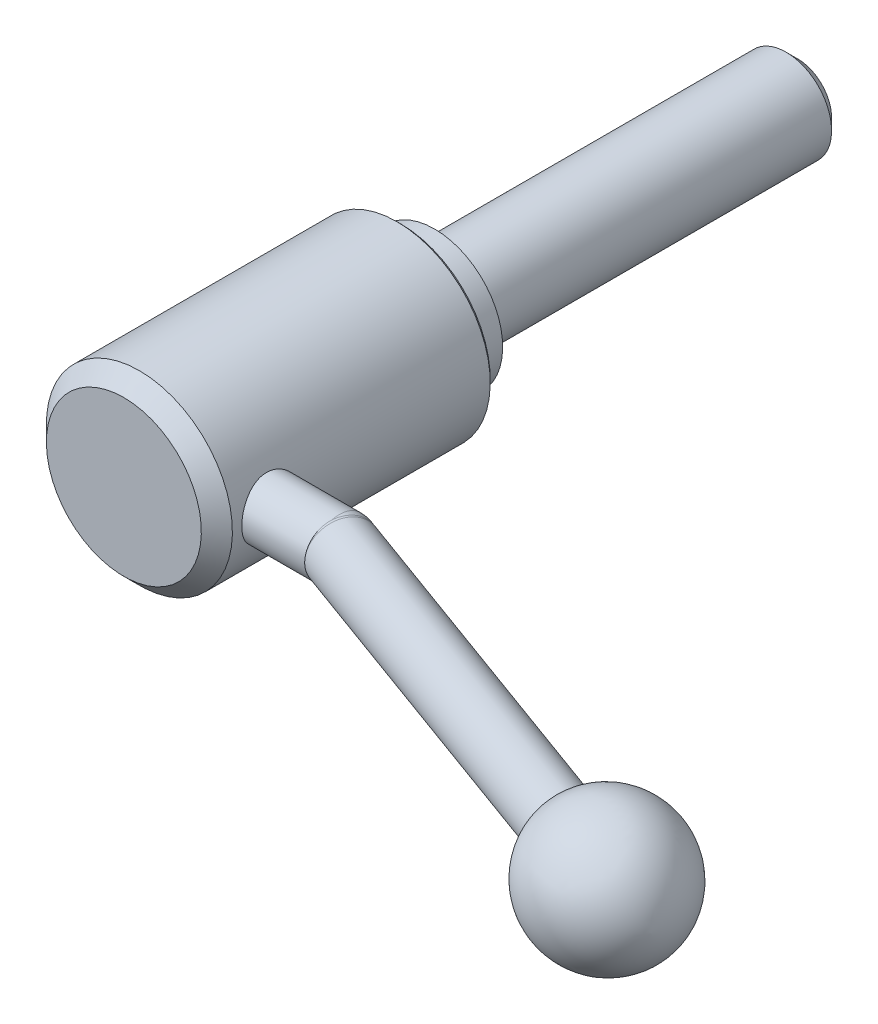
ISO-10303-21;
HEADER;
FILE_DESCRIPTION(('STEP AP214'),'2;1');
FILE_NAME('part.step','',(''),(''),'','','');
FILE_SCHEMA(('AUTOMOTIVE_DESIGN { 1 0 10303 214 1 1 1 1 }'));
ENDSEC;
DATA;
#1=APPLICATION_CONTEXT('core data for automotive mechanical design processes');
#2=APPLICATION_PROTOCOL_DEFINITION('international standard','automotive_design',2000,#1);
#3=PRODUCT_CONTEXT('',#1,'mechanical');
#4=PRODUCT('Part','Part','',(#3));
#5=PRODUCT_RELATED_PRODUCT_CATEGORY('part','',(#4));
#6=PRODUCT_DEFINITION_FORMATION('','',#4);
#7=PRODUCT_DEFINITION_CONTEXT('part definition',#1,'design');
#8=PRODUCT_DEFINITION('design','',#6,#7);
#9=PRODUCT_DEFINITION_SHAPE('','',#8);
#10=(LENGTH_UNIT() NAMED_UNIT(*) SI_UNIT(.MILLI.,.METRE.));
#11=(NAMED_UNIT(*) PLANE_ANGLE_UNIT() SI_UNIT($,.RADIAN.));
#12=(NAMED_UNIT(*) SI_UNIT($,.STERADIAN.) SOLID_ANGLE_UNIT());
#13=UNCERTAINTY_MEASURE_WITH_UNIT(LENGTH_MEASURE(1.E-05),#10,'distance_accuracy_value','');
#14=(GEOMETRIC_REPRESENTATION_CONTEXT(3) GLOBAL_UNCERTAINTY_ASSIGNED_CONTEXT((#13)) GLOBAL_UNIT_ASSIGNED_CONTEXT((#10,
#11,#12)) REPRESENTATION_CONTEXT('',''));
#15=CARTESIAN_POINT('',(0.,0.,0.));
#16=DIRECTION('',(0.,0.,1.));
#17=DIRECTION('',(1.,0.,0.));
#18=AXIS2_PLACEMENT_3D('',#15,#16,#17);
#19=CARTESIAN_POINT('',(0.,0.,0.));
#20=DIRECTION('',(0.,0.,-1.));
#21=DIRECTION('',(0.,1.,0.));
#22=AXIS2_PLACEMENT_3D('',#19,#20,#21);
#23=CYLINDRICAL_SURFACE('',#22,20.5);
#24=CARTESIAN_POINT('',(0.,0.,8.25));
#25=DIRECTION('',(0.,0.,-1.));
#26=DIRECTION('',(0.,1.,0.));
#27=AXIS2_PLACEMENT_3D('',#24,#25,#26);
#28=CIRCLE('',#27,20.5);
#29=CARTESIAN_POINT('',(0.,20.5,8.25));
#30=VERTEX_POINT('',#29);
#31=EDGE_CURVE('E160',#30,#30,#28,.T.);
#32=ORIENTED_EDGE('',*,*,#31,.F.);
#33=EDGE_LOOP('',(#32));
#34=FACE_BOUND('',#33,.T.);
#35=CARTESIAN_POINT('',(19.4422220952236,6.5,56.5));
#36=CARTESIAN_POINT('',(19.4422222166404,6.49999984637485,56.6775608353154));
#37=CARTESIAN_POINT('',(19.4446611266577,6.49271825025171,56.8551242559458));
#38=CARTESIAN_POINT('',(19.454338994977,6.46366201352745,57.2089295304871));
#39=CARTESIAN_POINT('',(19.4615780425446,6.44188710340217,57.3851713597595));
#40=CARTESIAN_POINT('',(19.4806268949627,6.38405046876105,57.7350468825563));
#41=CARTESIAN_POINT('',(19.4924368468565,6.34798828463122,57.9086804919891));
#42=CARTESIAN_POINT('',(19.5202654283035,6.26189122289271,58.2521641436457));
#43=CARTESIAN_POINT('',(19.5362855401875,6.2118514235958,58.4220128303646));
#44=CARTESIAN_POINT('',(19.5720112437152,6.09835258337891,58.7563693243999));
#45=CARTESIAN_POINT('',(19.5917092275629,6.03492120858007,58.9208873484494));
#46=CARTESIAN_POINT('',(19.6342385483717,5.89508386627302,59.2438952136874));
#47=CARTESIAN_POINT('',(19.6570700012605,5.8186774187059,59.4023848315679));
#48=CARTESIAN_POINT('',(19.7052295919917,5.65343532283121,59.7124029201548));
#49=CARTESIAN_POINT('',(19.7305584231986,5.5645962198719,59.8639294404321));
#50=CARTESIAN_POINT('',(19.7830095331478,5.37514542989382,60.159036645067));
#51=CARTESIAN_POINT('',(19.810131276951,5.27453724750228,60.3026196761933));
#52=CARTESIAN_POINT('',(19.8663573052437,5.05872294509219,60.5855845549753));
#53=CARTESIAN_POINT('',(19.8954973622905,4.94314912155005,60.7246789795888));
#54=CARTESIAN_POINT('',(19.9541229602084,4.70090397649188,60.9926738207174));
#55=CARTESIAN_POINT('',(19.9836083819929,4.57423638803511,61.1215776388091));
#56=CARTESIAN_POINT('',(20.0421539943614,4.31048905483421,61.3685042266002));
#57=CARTESIAN_POINT('',(20.071213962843,4.1734040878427,61.4865214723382));
#58=CARTESIAN_POINT('',(20.1281044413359,3.88977145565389,61.7107919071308));
#59=CARTESIAN_POINT('',(20.1559354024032,3.74322731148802,61.8170494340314));
#60=CARTESIAN_POINT('',(20.2102746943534,3.43793523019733,62.0195055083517));
#61=CARTESIAN_POINT('',(20.236735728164,3.2789797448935,62.1154041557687));
#62=CARTESIAN_POINT('',(20.2868421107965,2.95316588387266,62.2933802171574));
#63=CARTESIAN_POINT('',(20.3104885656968,2.786310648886,62.3754630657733));
#64=CARTESIAN_POINT('',(20.3543059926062,2.44575238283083,62.5251888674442));
#65=CARTESIAN_POINT('',(20.3744761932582,2.27204784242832,62.5928286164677));
#66=CARTESIAN_POINT('',(20.4107390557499,1.9191592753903,62.7130148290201));
#67=CARTESIAN_POINT('',(20.4268335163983,1.73997770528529,62.7655679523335));
#68=CARTESIAN_POINT('',(20.4540467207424,1.38310784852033,62.8537177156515));
#69=CARTESIAN_POINT('',(20.4653055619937,1.20554867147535,62.8897940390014));
#70=CARTESIAN_POINT('',(20.483240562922,0.847880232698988,62.9470057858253));
#71=CARTESIAN_POINT('',(20.489918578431,0.667772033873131,62.9681472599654));
#72=CARTESIAN_POINT('',(20.4985086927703,0.306306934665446,62.9953079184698));
#73=CARTESIAN_POINT('',(20.5004208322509,0.124950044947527,63.0013272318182));
#74=CARTESIAN_POINT('',(20.4994243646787,-0.237616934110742,62.9981845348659));
#75=CARTESIAN_POINT('',(20.4965158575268,-0.418827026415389,62.9890228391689));
#76=CARTESIAN_POINT('',(20.4861511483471,-0.773249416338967,62.9562077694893));
#77=CARTESIAN_POINT('',(20.4788613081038,-0.946515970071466,62.9330843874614));
#78=CARTESIAN_POINT('',(20.4600679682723,-1.29046183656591,62.8730051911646));
#79=CARTESIAN_POINT('',(20.4485630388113,-1.46114025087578,62.8360446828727));
#80=CARTESIAN_POINT('',(20.4216452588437,-1.798625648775,62.7486256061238));
#81=CARTESIAN_POINT('',(20.4062336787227,-1.9654338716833,62.6981714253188));
#82=CARTESIAN_POINT('',(20.3718916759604,-2.29420139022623,62.5841535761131));
#83=CARTESIAN_POINT('',(20.35295992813,-2.45615883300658,62.5205849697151));
#84=CARTESIAN_POINT('',(20.3118147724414,-2.77605889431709,62.3799991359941));
#85=CARTESIAN_POINT('',(20.2895645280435,-2.93392950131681,62.3028289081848));
#86=CARTESIAN_POINT('',(20.2425168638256,-3.24266972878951,62.1361230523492));
#87=CARTESIAN_POINT('',(20.2177185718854,-3.39353692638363,62.0465831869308));
#88=CARTESIAN_POINT('',(20.1662066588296,-3.68732340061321,61.8557751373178));
#89=CARTESIAN_POINT('',(20.1394929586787,-3.8302423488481,61.7545064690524));
#90=CARTESIAN_POINT('',(20.0848204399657,-4.10730208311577,61.5408997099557));
#91=CARTESIAN_POINT('',(20.0568615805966,-4.24144258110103,61.4285612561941));
#92=CARTESIAN_POINT('',(19.9991827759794,-4.50574800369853,61.1884400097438));
#93=CARTESIAN_POINT('',(19.9694388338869,-4.63549313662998,61.0602005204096));
#94=CARTESIAN_POINT('',(19.9101839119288,-4.88373422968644,60.7932909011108));
#95=CARTESIAN_POINT('',(19.8806728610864,-5.00223374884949,60.6546240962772));
#96=CARTESIAN_POINT('',(19.8226810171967,-5.22731613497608,60.3676143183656));
#97=CARTESIAN_POINT('',(19.7942007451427,-5.33389303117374,60.2192665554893));
#98=CARTESIAN_POINT('',(19.739110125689,-5.53428674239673,59.9139422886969));
#99=CARTESIAN_POINT('',(19.7124990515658,-5.62810852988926,59.7569691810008));
#100=CARTESIAN_POINT('',(19.6616069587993,-5.80341705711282,59.4333642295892));
#101=CARTESIAN_POINT('',(19.6373585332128,-5.88473833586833,59.2666375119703));
#102=CARTESIAN_POINT('',(19.5923338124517,-6.03294761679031,58.9265081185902));
#103=CARTESIAN_POINT('',(19.5715561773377,-6.09984119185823,58.7531080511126));
#104=CARTESIAN_POINT('',(19.5341361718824,-6.21863379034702,58.4008267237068));
#105=CARTESIAN_POINT('',(19.5174933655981,-6.2705343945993,58.2219460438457));
#106=CARTESIAN_POINT('',(19.4888985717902,-6.35885149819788,57.8600357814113));
#107=CARTESIAN_POINT('',(19.4769463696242,-6.39526870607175,57.6770063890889));
#108=CARTESIAN_POINT('',(19.4585313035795,-6.45107630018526,57.3158506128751));
#109=CARTESIAN_POINT('',(19.4518622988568,-6.47110721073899,57.1378335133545));
#110=CARTESIAN_POINT('',(19.443427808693,-6.49640633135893,56.7806394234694));
#111=CARTESIAN_POINT('',(19.4416621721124,-6.50167499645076,56.6014624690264));
#112=CARTESIAN_POINT('',(19.443091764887,-6.49739848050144,56.2433320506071));
#113=CARTESIAN_POINT('',(19.4462862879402,-6.48785540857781,56.0643785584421));
#114=CARTESIAN_POINT('',(19.4575309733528,-6.45405335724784,55.7080231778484));
#115=CARTESIAN_POINT('',(19.4655810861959,-6.4297945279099,55.5306212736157));
#116=CARTESIAN_POINT('',(19.4859636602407,-6.36775067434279,55.1840196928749));
#117=CARTESIAN_POINT('',(19.4981590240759,-6.33039761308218,55.0147343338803));
#118=CARTESIAN_POINT('',(19.5265148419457,-6.24238368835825,54.6799411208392));
#119=CARTESIAN_POINT('',(19.5426766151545,-6.19171839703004,54.5144345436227));
#120=CARTESIAN_POINT('',(19.5784935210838,-6.07751333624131,54.1883625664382));
#121=CARTESIAN_POINT('',(19.598147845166,-6.01397654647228,54.0277960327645));
#122=CARTESIAN_POINT('',(19.6404122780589,-5.87448001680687,53.7124890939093));
#123=CARTESIAN_POINT('',(19.663023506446,-5.79851556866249,53.5577509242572));
#124=CARTESIAN_POINT('',(19.711276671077,-5.63234141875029,53.2506795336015));
#125=CARTESIAN_POINT('',(19.7369874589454,-5.54178262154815,53.0985460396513));
#126=CARTESIAN_POINT('',(19.7901869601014,-5.34869406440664,52.8023330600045));
#127=CARTESIAN_POINT('',(19.8176762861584,-5.24616016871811,52.6582563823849));
#128=CARTESIAN_POINT('',(19.8736901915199,-5.02980339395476,52.3790447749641));
#129=CARTESIAN_POINT('',(19.9022148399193,-4.91597976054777,52.2439104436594));
#130=CARTESIAN_POINT('',(19.9595511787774,-4.67774787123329,51.9833824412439));
#131=CARTESIAN_POINT('',(19.9883628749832,-4.55333940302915,51.8579889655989));
#132=CARTESIAN_POINT('',(20.0467640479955,-4.28909489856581,51.612508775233));
#133=CARTESIAN_POINT('',(20.0763335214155,-4.14882502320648,51.4928837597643));
#134=CARTESIAN_POINT('',(20.1341446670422,-3.85851185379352,51.2658977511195));
#135=CARTESIAN_POINT('',(20.1623867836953,-3.70847187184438,51.1585326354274));
#136=CARTESIAN_POINT('',(20.2167791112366,-3.39947872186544,50.956751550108));
#137=CARTESIAN_POINT('',(20.2429285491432,-3.24052229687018,50.8623403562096));
#138=CARTESIAN_POINT('',(20.2923799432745,-2.91486277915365,50.6872782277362));
#139=CARTESIAN_POINT('',(20.31568308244,-2.74816294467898,50.606621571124));
#140=CARTESIAN_POINT('',(20.3586447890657,-2.40926409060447,50.4601915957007));
#141=CARTESIAN_POINT('',(20.3783271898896,-2.23711047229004,50.3943202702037));
#142=CARTESIAN_POINT('',(20.4136744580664,-1.88752303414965,50.2773627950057));
#143=CARTESIAN_POINT('',(20.4293409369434,-1.71009136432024,50.2262707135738));
#144=CARTESIAN_POINT('',(20.4562117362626,-1.35121271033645,50.1393152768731));
#145=CARTESIAN_POINT('',(20.4674163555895,-1.16976599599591,50.1034509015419));
#146=CARTESIAN_POINT('',(20.4850348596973,-0.804250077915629,50.0472977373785));
#147=CARTESIAN_POINT('',(20.4914489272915,-0.620180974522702,50.0270083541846));
#148=CARTESIAN_POINT('',(20.4991281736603,-0.258824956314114,50.0027406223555));
#149=CARTESIAN_POINT('',(20.5006028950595,-0.0815867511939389,49.9980984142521));
#150=CARTESIAN_POINT('',(20.4989516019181,0.272717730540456,50.0033067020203));
#151=CARTESIAN_POINT('',(20.4958240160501,0.449783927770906,50.0131621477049));
#152=CARTESIAN_POINT('',(20.4850529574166,0.802303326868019,50.0472753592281));
#153=CARTESIAN_POINT('',(20.477411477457,0.977757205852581,50.0715267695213));
#154=CARTESIAN_POINT('',(20.4578179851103,1.32593306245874,50.1342162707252));
#155=CARTESIAN_POINT('',(20.4458643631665,1.49865399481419,50.1726596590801));
#156=CARTESIAN_POINT('',(20.4181583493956,1.83775920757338,50.2627729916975));
#157=CARTESIAN_POINT('',(20.4024599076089,2.00419775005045,50.314255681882));
#158=CARTESIAN_POINT('',(20.3675799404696,2.33214296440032,50.430290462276));
#159=CARTESIAN_POINT('',(20.3483971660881,2.49364784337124,50.4948472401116));
#160=CARTESIAN_POINT('',(20.3070431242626,2.8106122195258,50.6365039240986));
#161=CARTESIAN_POINT('',(20.2848725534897,2.96607311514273,50.7136009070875));
#162=CARTESIAN_POINT('',(20.2380837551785,3.2701125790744,50.8798225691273));
#163=CARTESIAN_POINT('',(20.2134646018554,3.41868851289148,50.9689518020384));
#164=CARTESIAN_POINT('',(20.1615167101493,3.71299497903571,51.1618658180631));
#165=CARTESIAN_POINT('',(20.1341240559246,3.85845386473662,51.2660479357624));
#166=CARTESIAN_POINT('',(20.0780825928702,4.14019829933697,51.4859491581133));
#167=CARTESIAN_POINT('',(20.0494333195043,4.27648040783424,51.6016725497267));
#168=CARTESIAN_POINT('',(19.991639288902,4.5389891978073,51.8438784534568));
#169=CARTESIAN_POINT('',(19.9624945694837,4.66521664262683,51.9703601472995));
#170=CARTESIAN_POINT('',(19.9044649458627,4.90690637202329,52.2333644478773));
#171=CARTESIAN_POINT('',(19.8755801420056,5.0223646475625,52.3698907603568));
#172=CARTESIAN_POINT('',(19.8178815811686,5.24550327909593,52.6569714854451));
#173=CARTESIAN_POINT('',(19.7891042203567,5.35278119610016,52.8078463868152));
#174=CARTESIAN_POINT('',(19.7335121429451,5.55422553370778,53.118455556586));
#175=CARTESIAN_POINT('',(19.7066974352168,5.64839189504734,53.2781898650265));
#176=CARTESIAN_POINT('',(19.6558508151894,5.82286763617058,53.6054219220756));
#177=CARTESIAN_POINT('',(19.6318180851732,5.90318109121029,53.77291736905));
#178=CARTESIAN_POINT('',(19.5872824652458,6.04931454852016,54.1145638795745));
#179=CARTESIAN_POINT('',(19.5667793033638,6.11513566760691,54.2887144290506));
#180=CARTESIAN_POINT('',(19.5313806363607,6.22722680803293,54.6288485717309));
#181=CARTESIAN_POINT('',(19.5161756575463,6.27460911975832,54.7944341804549));
#182=CARTESIAN_POINT('',(19.4897776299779,6.35613148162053,55.1291406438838));
#183=CARTESIAN_POINT('',(19.4785842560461,6.39027260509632,55.2982612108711));
#184=CARTESIAN_POINT('',(19.4605385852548,6.44501906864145,55.6389039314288));
#185=CARTESIAN_POINT('',(19.4536861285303,6.46562490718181,55.8104259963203));
#186=CARTESIAN_POINT('',(19.4445285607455,6.49311322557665,56.1546314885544));
#187=CARTESIAN_POINT('',(19.4422219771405,6.50000014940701,56.3273145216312));
#188=CARTESIAN_POINT('',(19.4422220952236,6.5,56.5));
#189=B_SPLINE_CURVE_WITH_KNOTS('',3,(#35,#36,#37,#38,#39,#40,#41,#42,#43,#44,#45,#46,#47,#48,
#49,#50,#51,#52,#53,#54,#55,#56,#57,#58,#59,#60,#61,#62,#63,#64,#65,#66,#67,#68,#69,#70,#71,#72,
#73,#74,#75,#76,#77,#78,#79,#80,#81,#82,#83,#84,#85,#86,#87,#88,#89,#90,#91,#92,#93,#94,#95,#96,
#97,#98,#99,#100,#101,#102,#103,#104,#105,#106,#107,#108,#109,#110,#111,#112,#113,#114,#115,
#116,#117,#118,#119,#120,#121,#122,#123,#124,#125,#126,#127,#128,#129,#130,#131,#132,#133,#134,
#135,#136,#137,#138,#139,#140,#141,#142,#143,#144,#145,#146,#147,#148,#149,#150,#151,#152,#153,
#154,#155,#156,#157,#158,#159,#160,#161,#162,#163,#164,#165,#166,#167,#168,#169,#170,#171,#172,
#173,#174,#175,#176,#177,#178,#179,#180,#181,#182,#183,#184,#185,#186,#187,#188),.UNSPECIFIED.,
.T.,.F.,(4,2,2,2,2,2,2,2,2,2,2,2,2,2,2,2,2,2,2,2,2,2,2,2,2,2,2,2,2,2,2,2,2,2,2,2,2,2,2,2,2,2,2,
2,2,2,2,2,2,2,2,2,2,2,2,2,2,2,2,2,2,2,2,2,2,2,2,2,2,2,2,2,2,2,2,2,4),(0.,0.532521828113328,
1.06505355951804,1.5976024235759,2.13033904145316,2.66198564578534,3.19365192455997,
3.72546623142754,4.25712257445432,4.80602728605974,5.35474799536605,5.90374561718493,
6.45254004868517,7.0144069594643,7.5760523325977,8.13782217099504,8.6993436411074,
9.24327177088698,9.78697940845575,10.3306824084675,10.8743741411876,11.3986215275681,
11.9230469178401,12.4473019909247,12.9717548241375,13.5025350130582,14.0334974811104,
14.5644818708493,15.0954836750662,15.6493464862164,16.2030334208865,16.7569964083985,
17.3107428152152,17.8712831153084,18.4316065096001,18.991870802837,19.5521094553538,
20.0892329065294,20.6263398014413,21.163370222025,21.7003951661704,22.2211537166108,
22.7420856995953,23.2628972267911,23.7839065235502,24.3200181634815,24.8563155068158,
25.3926487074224,25.9289926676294,26.488454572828,27.0477277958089,27.6072066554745,
28.1664521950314,28.7218733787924,29.2770713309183,29.8322320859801,30.3873716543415,
30.9186402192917,31.4500902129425,31.9813057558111,32.512719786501,33.0368968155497,
33.5612621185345,34.0855053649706,34.6099475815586,35.1523480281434,35.6949507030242,
36.237512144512,36.7802747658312,37.3416479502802,37.9030236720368,38.4642339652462,
39.0254009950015,39.5435300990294,40.061617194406,40.579685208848,41.0975853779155),.UNSPECIFIED.);
#190=CARTESIAN_POINT('',(19.4422220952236,6.5,56.5));
#191=VERTEX_POINT('',#190);
#192=EDGE_CURVE('E79',#191,#191,#189,.T.);
#193=ORIENTED_EDGE('',*,*,#192,.F.);
#194=EDGE_LOOP('',(#193));
#195=FACE_BOUND('',#194,.T.);
#196=CARTESIAN_POINT('',(0.,0.,65.075));
#197=DIRECTION('',(0.,0.,-1.));
#198=DIRECTION('',(0.,1.,0.));
#199=AXIS2_PLACEMENT_3D('',#196,#197,#198);
#200=CIRCLE('',#199,20.5);
#201=CARTESIAN_POINT('',(0.,20.5,65.075));
#202=VERTEX_POINT('',#201);
#203=EDGE_CURVE('E163',#202,#202,#200,.T.);
#204=ORIENTED_EDGE('',*,*,#203,.T.);
#205=EDGE_LOOP('',(#204));
#206=FACE_BOUND('',#205,.T.);
#207=ADVANCED_FACE('F15',(#34,#195,#206),#23,.T.);
#208=CARTESIAN_POINT('',(0.,0.,68.5));
#209=DIRECTION('',(0.,0.,-1.));
#210=DIRECTION('',(0.,1.,0.));
#211=AXIS2_PLACEMENT_3D('',#208,#209,#210);
#212=PLANE('',#211);
#213=CARTESIAN_POINT('',(0.,0.,68.5));
#214=DIRECTION('',(0.,0.,-1.));
#215=DIRECTION('',(0.,1.,0.));
#216=AXIS2_PLACEMENT_3D('',#213,#214,#215);
#217=CIRCLE('',#216,17.075);
#218=CARTESIAN_POINT('',(0.,17.075,68.5));
#219=VERTEX_POINT('',#218);
#220=EDGE_CURVE('E88',#219,#219,#217,.T.);
#221=ORIENTED_EDGE('',*,*,#220,.F.);
#222=EDGE_LOOP('',(#221));
#223=FACE_BOUND('',#222,.T.);
#224=ADVANCED_FACE('F63',(#223),#212,.F.);
#225=CARTESIAN_POINT('',(0.,0.,68.5));
#226=DIRECTION('',(0.,0.,-1.));
#227=DIRECTION('',(0.,1.,0.));
#228=AXIS2_PLACEMENT_3D('',#225,#226,#227);
#229=CONICAL_SURFACE('',#228,17.075,0.785398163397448);
#230=ORIENTED_EDGE('',*,*,#203,.F.);
#231=EDGE_LOOP('',(#230));
#232=FACE_BOUND('',#231,.T.);
#233=ORIENTED_EDGE('',*,*,#220,.T.);
#234=EDGE_LOOP('',(#233));
#235=FACE_BOUND('',#234,.T.);
#236=ADVANCED_FACE('F69',(#232,#235),#229,.T.);
#237=CARTESIAN_POINT('',(0.,0.,8.25));
#238=DIRECTION('',(0.,0.,1.));
#239=DIRECTION('',(0.,-1.,0.));
#240=AXIS2_PLACEMENT_3D('',#237,#238,#239);
#241=CONICAL_SURFACE('',#240,20.5,0.785398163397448);
#242=CARTESIAN_POINT('',(0.,0.,7.5));
#243=DIRECTION('',(0.,0.,-1.));
#244=DIRECTION('',(0.,1.,0.));
#245=AXIS2_PLACEMENT_3D('',#242,#243,#244);
#246=CIRCLE('',#245,19.75);
#247=CARTESIAN_POINT('',(0.,19.75,7.5));
#248=VERTEX_POINT('',#247);
#249=EDGE_CURVE('E154',#248,#248,#246,.T.);
#250=ORIENTED_EDGE('',*,*,#249,.F.);
#251=EDGE_LOOP('',(#250));
#252=FACE_BOUND('',#251,.T.);
#253=ORIENTED_EDGE('',*,*,#31,.T.);
#254=EDGE_LOOP('',(#253));
#255=FACE_BOUND('',#254,.T.);
#256=ADVANCED_FACE('F76',(#252,#255),#241,.T.);
#257=CARTESIAN_POINT('',(19.75,0.,7.5));
#258=DIRECTION('',(0.,0.,1.));
#259=DIRECTION('',(0.,-1.,0.));
#260=AXIS2_PLACEMENT_3D('',#257,#258,#259);
#261=PLANE('',#260);
#262=CARTESIAN_POINT('',(0.,0.,7.5));
#263=DIRECTION('',(0.,0.,-1.));
#264=DIRECTION('',(0.,1.,0.));
#265=AXIS2_PLACEMENT_3D('',#262,#263,#264);
#266=CIRCLE('',#265,15.);
#267=CARTESIAN_POINT('',(0.,15.,7.5));
#268=VERTEX_POINT('',#267);
#269=EDGE_CURVE('E150',#268,#268,#266,.T.);
#270=ORIENTED_EDGE('',*,*,#269,.F.);
#271=EDGE_LOOP('',(#270));
#272=FACE_BOUND('',#271,.T.);
#273=ORIENTED_EDGE('',*,*,#249,.T.);
#274=EDGE_LOOP('',(#273));
#275=FACE_BOUND('',#274,.T.);
#276=ADVANCED_FACE('F177',(#272,#275),#261,.F.);
#277=CARTESIAN_POINT('',(0.,0.,0.));
#278=DIRECTION('',(0.,0.,-1.));
#279=DIRECTION('',(0.,1.,0.));
#280=AXIS2_PLACEMENT_3D('',#277,#278,#279);
#281=CYLINDRICAL_SURFACE('',#280,15.);
#282=CARTESIAN_POINT('',(0.,0.,0.));
#283=DIRECTION('',(0.,0.,-1.));
#284=DIRECTION('',(0.,1.,0.));
#285=AXIS2_PLACEMENT_3D('',#282,#283,#284);
#286=CIRCLE('',#285,15.);
#287=CARTESIAN_POINT('',(0.,15.,0.));
#288=VERTEX_POINT('',#287);
#289=EDGE_CURVE('E147',#288,#288,#286,.T.);
#290=ORIENTED_EDGE('',*,*,#289,.F.);
#291=EDGE_LOOP('',(#290));
#292=FACE_BOUND('',#291,.T.);
#293=ORIENTED_EDGE('',*,*,#269,.T.);
#294=EDGE_LOOP('',(#293));
#295=FACE_BOUND('',#294,.T.);
#296=ADVANCED_FACE('F144',(#292,#295),#281,.T.);
#297=CARTESIAN_POINT('',(15.,0.,0.));
#298=DIRECTION('',(0.,0.,1.));
#299=DIRECTION('',(0.,-1.,0.));
#300=AXIS2_PLACEMENT_3D('',#297,#298,#299);
#301=PLANE('',#300);
#302=CARTESIAN_POINT('',(0.,0.,0.));
#303=DIRECTION('',(0.,0.,-1.));
#304=DIRECTION('',(0.,1.,0.));
#305=AXIS2_PLACEMENT_3D('',#302,#303,#304);
#306=CIRCLE('',#305,10.);
#307=CARTESIAN_POINT('',(0.,10.,0.));
#308=VERTEX_POINT('',#307);
#309=EDGE_CURVE('E134',#308,#308,#306,.T.);
#310=ORIENTED_EDGE('',*,*,#309,.F.);
#311=EDGE_LOOP('',(#310));
#312=FACE_BOUND('',#311,.T.);
#313=ORIENTED_EDGE('',*,*,#289,.T.);
#314=EDGE_LOOP('',(#313));
#315=FACE_BOUND('',#314,.T.);
#316=ADVANCED_FACE('F96',(#312,#315),#301,.F.);
#317=CARTESIAN_POINT('',(42.,0.,56.5));
#318=DIRECTION('',(1.,0.,0.));
#319=DIRECTION('',(0.,1.,0.));
#320=AXIS2_PLACEMENT_3D('',#317,#318,#319);
#321=CYLINDRICAL_SURFACE('',#320,6.5);
#322=CARTESIAN_POINT('',(35.5002,-6.28048269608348,58.1749737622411));
#323=CARTESIAN_POINT('',(35.4701911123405,-6.2584855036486,58.2574684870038));
#324=CARTESIAN_POINT('',(35.4414052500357,-6.23475002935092,58.3399237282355));
#325=CARTESIAN_POINT('',(35.3859523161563,-6.18381246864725,58.5044625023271));
#326=CARTESIAN_POINT('',(35.3592849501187,-6.15661086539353,58.5865460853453));
#327=CARTESIAN_POINT('',(35.2819864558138,-6.06984393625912,58.8317442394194));
#328=CARTESIAN_POINT('',(35.2340264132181,-6.00509209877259,58.9938982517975));
#329=CARTESIAN_POINT('',(35.1437652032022,-5.8621289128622,59.3135555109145));
#330=CARTESIAN_POINT('',(35.1014588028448,-5.78393016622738,59.471062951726));
#331=CARTESIAN_POINT('',(35.0215196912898,-5.61443273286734,59.7801227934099));
#332=CARTESIAN_POINT('',(34.9838873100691,-5.5231331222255,59.9316747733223));
#333=CARTESIAN_POINT('',(34.9127228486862,-5.32805112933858,60.2273614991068));
#334=CARTESIAN_POINT('',(34.8791877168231,-5.22427815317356,60.371501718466));
#335=CARTESIAN_POINT('',(34.8157745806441,-5.00483968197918,60.6512875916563));
#336=CARTESIAN_POINT('',(34.7858966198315,-4.88917404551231,60.7869331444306));
#337=CARTESIAN_POINT('',(34.7295154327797,-4.64671898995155,61.048605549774));
#338=CARTESIAN_POINT('',(34.7030116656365,-4.51993135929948,61.1746339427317));
#339=CARTESIAN_POINT('',(34.6531671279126,-4.25605741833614,61.4160918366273));
#340=CARTESIAN_POINT('',(34.6298263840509,-4.11897102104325,61.5315212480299));
#341=CARTESIAN_POINT('',(34.5859306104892,-3.83395076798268,61.7520111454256));
#342=CARTESIAN_POINT('',(34.5654071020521,-3.68591886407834,61.8569512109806));
#343=CARTESIAN_POINT('',(34.5273160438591,-3.38127311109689,62.0542722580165));
#344=CARTESIAN_POINT('',(34.5097495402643,-3.22465625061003,62.1466487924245));
#345=CARTESIAN_POINT('',(34.4775004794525,-2.90402878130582,62.3180456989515));
#346=CARTESIAN_POINT('',(34.4628174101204,-2.74001949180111,62.3970684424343));
#347=CARTESIAN_POINT('',(34.4362651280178,-2.4056942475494,62.5411738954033));
#348=CARTESIAN_POINT('',(34.424396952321,-2.23537599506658,62.606251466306));
#349=CARTESIAN_POINT('',(34.4035252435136,-1.89117431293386,62.7214241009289));
#350=CARTESIAN_POINT('',(34.3944984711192,-1.71733288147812,62.7716404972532));
#351=CARTESIAN_POINT('',(34.3791416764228,-1.36588965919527,62.8574425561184));
#352=CARTESIAN_POINT('',(34.3728126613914,-1.18828648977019,62.8930227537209));
#353=CARTESIAN_POINT('',(34.3628391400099,-0.830755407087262,62.9492305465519));
#354=CARTESIAN_POINT('',(34.3591931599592,-0.650828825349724,62.9698663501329));
#355=CARTESIAN_POINT('',(34.3545680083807,-0.289765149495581,62.996061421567));
#356=CARTESIAN_POINT('',(34.3535900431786,-0.108627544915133,63.0016138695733));
#357=CARTESIAN_POINT('',(34.3542996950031,0.252555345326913,62.9975893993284));
#358=CARTESIAN_POINT('',(34.355973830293,0.43260151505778,62.9880890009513));
#359=CARTESIAN_POINT('',(34.361966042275,0.791157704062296,62.9541833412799));
#360=CARTESIAN_POINT('',(34.3662829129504,0.969668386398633,62.9297848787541));
#361=CARTESIAN_POINT('',(34.377575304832,1.32405576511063,62.8662625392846));
#362=CARTESIAN_POINT('',(34.3845521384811,1.49993111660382,62.8271313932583));
#363=CARTESIAN_POINT('',(34.4011832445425,1.847645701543,62.7344660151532));
#364=CARTESIAN_POINT('',(34.4108365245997,2.01948640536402,62.6809371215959));
#365=CARTESIAN_POINT('',(34.4328583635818,2.35804742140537,62.5598634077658));
#366=CARTESIAN_POINT('',(34.4452278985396,2.52476586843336,62.4923135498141));
#367=CARTESIAN_POINT('',(34.472721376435,2.85178734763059,62.3437616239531));
#368=CARTESIAN_POINT('',(34.4878443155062,3.01209269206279,62.2627644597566));
#369=CARTESIAN_POINT('',(34.5209144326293,3.32526997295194,62.0879110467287));
#370=CARTESIAN_POINT('',(34.538862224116,3.47814028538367,61.9940520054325));
#371=CARTESIAN_POINT('',(34.5776589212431,3.77530504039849,61.7942532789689));
#372=CARTESIAN_POINT('',(34.5985068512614,3.9196023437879,61.6883176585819));
#373=CARTESIAN_POINT('',(34.6433408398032,4.199419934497,61.4645872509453));
#374=CARTESIAN_POINT('',(34.6673426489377,4.33489069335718,61.3467336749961));
#375=CARTESIAN_POINT('',(34.7185603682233,4.59531298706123,61.1005655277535));
#376=CARTESIAN_POINT('',(34.7457763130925,4.72026440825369,60.9722508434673));
#377=CARTESIAN_POINT('',(34.8036465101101,4.95882988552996,60.70617837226));
#378=CARTESIAN_POINT('',(34.8343011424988,5.07244268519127,60.5684195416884));
#379=CARTESIAN_POINT('',(34.8993555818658,5.28757920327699,60.2846019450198));
#380=CARTESIAN_POINT('',(34.9337552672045,5.38910331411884,60.1385434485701));
#381=CARTESIAN_POINT('',(35.0048466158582,5.57448375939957,59.8471450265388));
#382=CARTESIAN_POINT('',(35.0413260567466,5.65898432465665,59.7021627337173));
#383=CARTESIAN_POINT('',(35.1186048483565,5.81610839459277,59.4070309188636));
#384=CARTESIAN_POINT('',(35.1594036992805,5.88873327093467,59.2568819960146));
#385=CARTESIAN_POINT('',(35.2461889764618,6.02181290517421,58.9526179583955));
#386=CARTESIAN_POINT('',(35.2921778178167,6.08226196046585,58.798501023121));
#387=CARTESIAN_POINT('',(35.3660624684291,6.16360062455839,58.5656236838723));
#388=CARTESIAN_POINT('',(35.3915152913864,6.18916346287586,58.4876924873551));
#389=CARTESIAN_POINT('',(35.4443438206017,6.23716716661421,58.3315099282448));
#390=CARTESIAN_POINT('',(35.4717197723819,6.25960763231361,58.2532585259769));
#391=CARTESIAN_POINT('',(35.5001999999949,6.28048269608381,58.17497376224));
#392=B_SPLINE_CURVE_WITH_KNOTS('',3,(#322,#323,#324,#325,#326,#327,#328,#329,#330,#331,#332,
#333,#334,#335,#336,#337,#338,#339,#340,#341,#342,#343,#344,#345,#346,#347,#348,#349,#350,#351,
#352,#353,#354,#355,#356,#357,#358,#359,#360,#361,#362,#363,#364,#365,#366,#367,#368,#369,#370,
#371,#372,#373,#374,#375,#376,#377,#378,#379,#380,#381,#382,#383,#384,#385,#386,#387,#388,#389,
#390,#391),.UNSPECIFIED.,.F.,.F.,(4,2,2,2,2,2,2,2,2,2,2,2,2,2,2,2,2,2,2,2,2,2,2,2,2,2,2,2,2,2,2,
2,2,2,4),(0.,0.271433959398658,0.542830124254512,1.08532167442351,1.62730757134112,
2.16933170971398,2.71094964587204,3.25257402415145,3.79411146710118,4.33565348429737,
4.88283172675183,5.43020315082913,5.97747727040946,6.52495270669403,7.06782653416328,
7.61090287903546,8.15368070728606,8.6967039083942,9.2369755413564,9.77700080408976,
10.3172928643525,10.8573848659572,11.3976712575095,11.9377610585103,12.4779683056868,
13.0179942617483,13.5608276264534,14.1036668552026,14.6465661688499,15.189447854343,
15.7040975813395,16.2186878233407,16.7335185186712,16.99107618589,17.2486667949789),.UNSPECIFIED.);
#393=CARTESIAN_POINT('',(35.5,-6.28033613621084,58.1755232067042));
#394=VERTEX_POINT('',#393);
#395=CARTESIAN_POINT('',(34.3538746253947,0.,63.));
#396=VERTEX_POINT('',#395);
#397=EDGE_CURVE('E31',#394,#396,#392,.T.);
#398=ORIENTED_EDGE('',*,*,#397,.T.);
#399=CARTESIAN_POINT('',(35.5,6.28033613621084,58.1755232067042));
#400=VERTEX_POINT('',#399);
#401=EDGE_CURVE('E101',#396,#400,#392,.T.);
#402=ORIENTED_EDGE('',*,*,#401,.T.);
#403=CARTESIAN_POINT('',(35.5,0.,56.5));
#404=DIRECTION('',(1.,0.,0.));
#405=DIRECTION('',(0.,1.,0.));
#406=AXIS2_PLACEMENT_3D('',#403,#404,#405);
#407=CIRCLE('',#406,6.5);
#408=EDGE_CURVE('E111',#394,#400,#407,.T.);
#409=ORIENTED_EDGE('',*,*,#408,.F.);
#410=EDGE_LOOP('',(#398,#402,#409));
#411=FACE_BOUND('',#410,.T.);
#412=ORIENTED_EDGE('',*,*,#192,.T.);
#413=EDGE_LOOP('',(#412));
#414=FACE_BOUND('',#413,.T.);
#415=ADVANCED_FACE('F90',(#411,#414),#321,.T.);
#416=CARTESIAN_POINT('',(35.5,0.,56.5));
#417=DIRECTION('',(1.,0.,0.));
#418=DIRECTION('',(0.,0.,-1.));
#419=AXIS2_PLACEMENT_3D('',#416,#417,#418);
#420=SPHERICAL_SURFACE('',#419,6.5);
#421=CARTESIAN_POINT('',(36.0385027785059,0.,56.6959989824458));
#422=DIRECTION('',(0.93969262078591,0.,0.342020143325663));
#423=DIRECTION('',(-0.342020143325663,0.,0.939692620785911));
#424=AXIS2_PLACEMENT_3D('',#421,#422,#423);
#425=CIRCLE('',#424,6.4746891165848);
#426=EDGE_CURVE('E38',#394,#400,#425,.T.);
#427=ORIENTED_EDGE('',*,*,#426,.F.);
#428=ORIENTED_EDGE('',*,*,#408,.T.);
#429=EDGE_LOOP('',(#427,#428));
#430=FACE_BOUND('',#429,.T.);
#431=ADVANCED_FACE('F95',(#430),#420,.T.);
#432=CARTESIAN_POINT('',(36.5770055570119,0.,56.8919979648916));
#433=DIRECTION('',(0.939692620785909,0.,0.342020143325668));
#434=DIRECTION('',(-0.342020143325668,0.,0.939692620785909));
#435=AXIS2_PLACEMENT_3D('',#432,#433,#434);
#436=SPHERICAL_SURFACE('',#435,6.5);
#437=ORIENTED_EDGE('',*,*,#397,.F.);
#438=ORIENTED_EDGE('',*,*,#426,.T.);
#439=ORIENTED_EDGE('',*,*,#401,.F.);
#440=CARTESIAN_POINT('',(36.5770055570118,0.,56.8919979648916));
#441=DIRECTION('',(0.939692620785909,0.,0.342020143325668));
#442=DIRECTION('',(-0.342020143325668,0.,0.939692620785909));
#443=AXIS2_PLACEMENT_3D('',#440,#441,#442);
#444=CIRCLE('',#443,6.5);
#445=EDGE_CURVE('E109',#396,#396,#444,.T.);
#446=ORIENTED_EDGE('',*,*,#445,.F.);
#447=EDGE_LOOP('',(#437,#438,#439,#446));
#448=FACE_BOUND('',#447,.T.);
#449=ADVANCED_FACE('F113',(#448),#436,.T.);
#450=CARTESIAN_POINT('',(143.243431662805,0.,95.7154020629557));
#451=DIRECTION('',(0.939692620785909,0.,0.342020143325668));
#452=DIRECTION('',(-0.342020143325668,0.,0.939692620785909));
#453=AXIS2_PLACEMENT_3D('',#450,#451,#452);
#454=CYLINDRICAL_SURFACE('',#453,6.5);
#455=CARTESIAN_POINT('',(116.198996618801,0.,85.8720327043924));
#456=DIRECTION('',(0.939692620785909,0.,0.342020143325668));
#457=DIRECTION('',(-0.342020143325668,0.,0.939692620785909));
#458=AXIS2_PLACEMENT_3D('',#455,#456,#457);
#459=CIRCLE('',#458,6.5);
#460=CARTESIAN_POINT('',(113.975865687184,0.,91.9800347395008));
#461=VERTEX_POINT('',#460);
#462=EDGE_CURVE('E125',#461,#461,#459,.T.);
#463=ORIENTED_EDGE('',*,*,#462,.F.);
#464=EDGE_LOOP('',(#463));
#465=FACE_BOUND('',#464,.T.);
#466=ORIENTED_EDGE('',*,*,#445,.T.);
#467=EDGE_LOOP('',(#466));
#468=FACE_BOUND('',#467,.T.);
#469=ADVANCED_FACE('F58',(#465,#468),#454,.T.);
#470=CARTESIAN_POINT('',(113.975865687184,0.,91.9800347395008));
#471=DIRECTION('',(0.939692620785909,0.,0.342020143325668));
#472=DIRECTION('',(-0.342020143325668,0.,0.939692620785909));
#473=AXIS2_PLACEMENT_3D('',#470,#471,#472);
#474=PLANE('',#473);
#475=CARTESIAN_POINT('',(116.198996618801,0.,85.8720327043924));
#476=DIRECTION('',(0.939692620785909,0.,0.342020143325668));
#477=DIRECTION('',(-0.342020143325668,0.,0.939692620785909));
#478=AXIS2_PLACEMENT_3D('',#475,#476,#477);
#479=CIRCLE('',#478,8.80198315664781);
#480=CARTESIAN_POINT('',(113.188541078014,0.,94.1431913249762));
#481=VERTEX_POINT('',#480);
#482=EDGE_CURVE('E131',#481,#481,#479,.T.);
#483=ORIENTED_EDGE('',*,*,#482,.F.);
#484=EDGE_LOOP('',(#483));
#485=FACE_BOUND('',#484,.T.);
#486=ORIENTED_EDGE('',*,*,#462,.T.);
#487=EDGE_LOOP('',(#486));
#488=FACE_BOUND('',#487,.T.);
#489=ADVANCED_FACE('F47',(#485,#488),#474,.F.);
#490=CARTESIAN_POINT('',(128.5,0.,89.5));
#491=DIRECTION('',(0.,1.,0.));
#492=DIRECTION('',(-0.342020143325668,0.,0.939692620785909));
#493=AXIS2_PLACEMENT_3D('',#490,#491,#492);
#494=CIRCLE('',#493,16.);
#495=TRIMMED_CURVE('',#494,(PARAMETER_VALUE(-1.52089957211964)),
(PARAMETER_VALUE(1.52089957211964)),.T.,.PARAMETER.);
#496=CARTESIAN_POINT('',(128.22706216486,0.,90.2498905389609));
#497=DIRECTION('',(0.939692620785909,0.,0.342020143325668));
#498=AXIS1_PLACEMENT('',#496,#497);
#499=SURFACE_OF_REVOLUTION('',#495,#498);
#500=ORIENTED_EDGE('',*,*,#482,.T.);
#501=EDGE_LOOP('',(#500));
#502=FACE_BOUND('',#501,.T.);
#503=CARTESIAN_POINT('',(143.243431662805,0.,95.7154020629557));
#504=VERTEX_POINT('',#503);
#505=VERTEX_LOOP('',#504);
#506=FACE_BOUND('',#505,.T.);
#507=ADVANCED_FACE('F44',(#502,#506),#499,.T.);
#508=CARTESIAN_POINT('',(0.,0.,27.));
#509=DIRECTION('',(0.,0.,-1.));
#510=DIRECTION('',(-1.,0.,0.));
#511=AXIS2_PLACEMENT_3D('',#508,#509,#510);
#512=CYLINDRICAL_SURFACE('',#511,10.);
#513=CARTESIAN_POINT('',(0.,0.,-77.5));
#514=DIRECTION('',(0.,0.,-1.));
#515=DIRECTION('',(-1.,0.,0.));
#516=AXIS2_PLACEMENT_3D('',#513,#514,#515);
#517=CIRCLE('',#516,10.);
#518=CARTESIAN_POINT('',(-10.,0.,-77.5));
#519=VERTEX_POINT('',#518);
#520=EDGE_CURVE('E9',#519,#519,#517,.F.);
#521=ORIENTED_EDGE('',*,*,#520,.T.);
#522=EDGE_LOOP('',(#521));
#523=FACE_BOUND('',#522,.T.);
#524=ORIENTED_EDGE('',*,*,#309,.T.);
#525=EDGE_LOOP('',(#524));
#526=FACE_BOUND('',#525,.T.);
#527=ADVANCED_FACE('F46',(#523,#526),#512,.T.);
#528=CARTESIAN_POINT('',(0.,0.,-80.));
#529=DIRECTION('',(0.,0.,-1.));
#530=DIRECTION('',(-1.,0.,0.));
#531=AXIS2_PLACEMENT_3D('',#528,#529,#530);
#532=PLANE('',#531);
#533=CARTESIAN_POINT('',(0.,0.,-80.));
#534=DIRECTION('',(0.,0.,-1.));
#535=DIRECTION('',(-1.,0.,0.));
#536=AXIS2_PLACEMENT_3D('',#533,#534,#535);
#537=CIRCLE('',#536,7.5);
#538=CARTESIAN_POINT('',(-7.5,0.,-80.));
#539=VERTEX_POINT('',#538);
#540=EDGE_CURVE('E24',#539,#539,#537,.T.);
#541=ORIENTED_EDGE('',*,*,#540,.T.);
#542=EDGE_LOOP('',(#541));
#543=FACE_BOUND('',#542,.T.);
#544=ADVANCED_FACE('F55',(#543),#532,.T.);
#545=CARTESIAN_POINT('',(0.,0.,-80.));
#546=DIRECTION('',(0.,0.,1.));
#547=DIRECTION('',(1.,0.,0.));
#548=AXIS2_PLACEMENT_3D('',#545,#546,#547);
#549=CONICAL_SURFACE('',#548,7.5,0.785398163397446);
#550=ORIENTED_EDGE('',*,*,#520,.F.);
#551=EDGE_LOOP('',(#550));
#552=FACE_BOUND('',#551,.T.);
#553=ORIENTED_EDGE('',*,*,#540,.F.);
#554=EDGE_LOOP('',(#553));
#555=FACE_BOUND('',#554,.T.);
#556=ADVANCED_FACE('F17',(#552,#555),#549,.T.);
#557=CLOSED_SHELL('',(#207,#224,#236,#256,#276,#296,#316,#415,#431,#449,#469,#489,#507,#527,
#544,#556));
#558=MANIFOLD_SOLID_BREP('B1',#557);
#559=ADVANCED_BREP_SHAPE_REPRESENTATION('',(#18,#558),#14);
#560=SHAPE_DEFINITION_REPRESENTATION(#9,#559);
ENDSEC;
END-ISO-10303-21;
